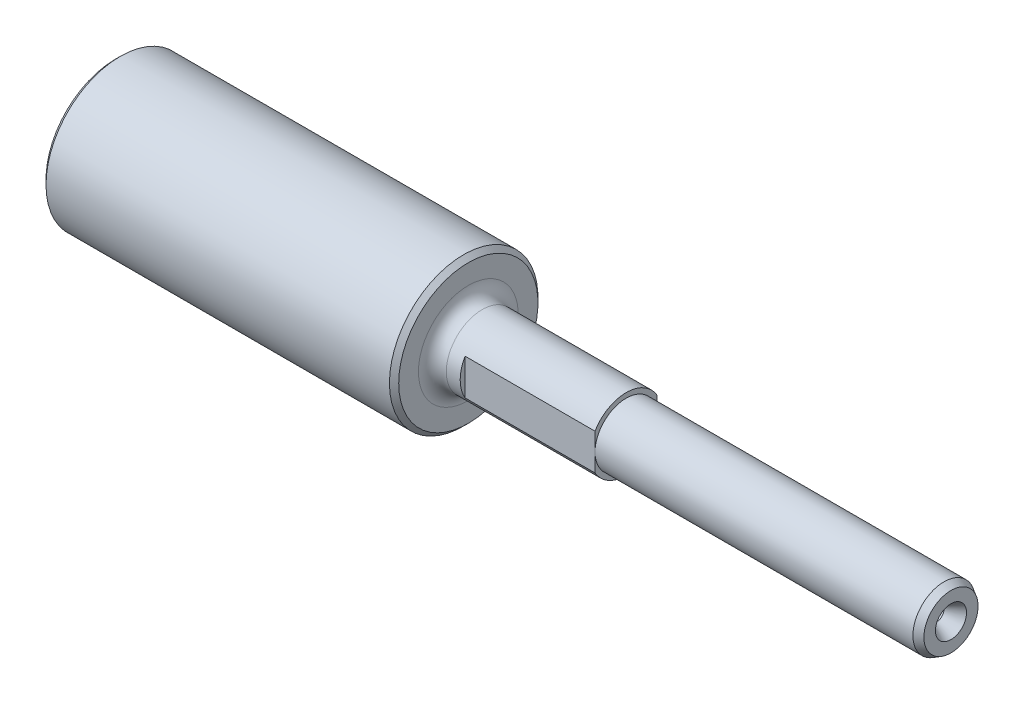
ISO-10303-21;
HEADER;
FILE_DESCRIPTION(('STEP AP214'),'2;1');
FILE_NAME('part.step','',(''),(''),'','','');
FILE_SCHEMA(('AUTOMOTIVE_DESIGN { 1 0 10303 214 1 1 1 1 }'));
ENDSEC;
DATA;
#1=APPLICATION_CONTEXT('core data for automotive mechanical design processes');
#2=APPLICATION_PROTOCOL_DEFINITION('international standard','automotive_design',2000,#1);
#3=PRODUCT_CONTEXT('',#1,'mechanical');
#4=PRODUCT('Part','Part','',(#3));
#5=PRODUCT_RELATED_PRODUCT_CATEGORY('part','',(#4));
#6=PRODUCT_DEFINITION_FORMATION('','',#4);
#7=PRODUCT_DEFINITION_CONTEXT('part definition',#1,'design');
#8=PRODUCT_DEFINITION('design','',#6,#7);
#9=PRODUCT_DEFINITION_SHAPE('','',#8);
#10=(LENGTH_UNIT() NAMED_UNIT(*) SI_UNIT(.MILLI.,.METRE.));
#11=(NAMED_UNIT(*) PLANE_ANGLE_UNIT() SI_UNIT($,.RADIAN.));
#12=(NAMED_UNIT(*) SI_UNIT($,.STERADIAN.) SOLID_ANGLE_UNIT());
#13=UNCERTAINTY_MEASURE_WITH_UNIT(LENGTH_MEASURE(1.E-05),#10,'distance_accuracy_value','');
#14=(GEOMETRIC_REPRESENTATION_CONTEXT(3) GLOBAL_UNCERTAINTY_ASSIGNED_CONTEXT((#13)) GLOBAL_UNIT_ASSIGNED_CONTEXT((#10,
#11,#12)) REPRESENTATION_CONTEXT('',''));
#15=CARTESIAN_POINT('',(0.,0.,0.));
#16=DIRECTION('',(0.,0.,1.));
#17=DIRECTION('',(1.,0.,0.));
#18=AXIS2_PLACEMENT_3D('',#15,#16,#17);
#19=CARTESIAN_POINT('',(0.,-6.7,0.));
#20=DIRECTION('',(-1.,0.,0.));
#21=DIRECTION('',(0.,0.,1.));
#22=AXIS2_PLACEMENT_3D('',#19,#20,#21);
#23=PLANE('',#22);
#24=CARTESIAN_POINT('',(0.,0.,0.));
#25=DIRECTION('',(-1.,0.,0.));
#26=DIRECTION('',(0.,0.,1.));
#27=AXIS2_PLACEMENT_3D('',#24,#25,#26);
#28=CIRCLE('',#27,7.75);
#29=CARTESIAN_POINT('',(0.,-3.89518934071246,-6.7));
#30=VERTEX_POINT('',#29);
#31=CARTESIAN_POINT('',(0.,-3.89518934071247,6.7));
#32=VERTEX_POINT('',#31);
#33=EDGE_CURVE('E60',#30,#32,#28,.T.);
#34=ORIENTED_EDGE('',*,*,#33,.F.);
#35=DIRECTION('',(0.,-1.,0.));
#36=VECTOR('',#35,1.);
#37=CARTESIAN_POINT('',(0.,3.89518934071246,-6.7));
#38=LINE('',#37,#36);
#39=CARTESIAN_POINT('',(0.,0.,-6.7));
#40=VERTEX_POINT('',#39);
#41=EDGE_CURVE('E98',#40,#30,#38,.T.);
#42=ORIENTED_EDGE('',*,*,#41,.F.);
#43=CARTESIAN_POINT('',(0.,0.,0.));
#44=DIRECTION('',(-1.,0.,0.));
#45=DIRECTION('',(0.,0.,1.));
#46=AXIS2_PLACEMENT_3D('',#43,#44,#45);
#47=CIRCLE('',#46,6.7);
#48=CARTESIAN_POINT('',(0.,0.,6.7));
#49=VERTEX_POINT('',#48);
#50=EDGE_CURVE('E129',#40,#49,#47,.T.);
#51=ORIENTED_EDGE('',*,*,#50,.T.);
#52=DIRECTION('',(0.,1.,0.));
#53=VECTOR('',#52,1.);
#54=CARTESIAN_POINT('',(0.,3.89518934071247,6.7));
#55=LINE('',#54,#53);
#56=EDGE_CURVE('E120',#32,#49,#55,.T.);
#57=ORIENTED_EDGE('',*,*,#56,.F.);
#58=EDGE_LOOP('',(#34,#42,#51,#57));
#59=FACE_BOUND('',#58,.T.);
#60=ADVANCED_FACE('F37',(#59),#23,.F.);
#61=CARTESIAN_POINT('',(70.,0.,0.));
#62=DIRECTION('',(-1.,0.,0.));
#63=DIRECTION('',(0.,0.,1.));
#64=AXIS2_PLACEMENT_3D('',#61,#62,#63);
#65=PLANE('',#64);
#66=CARTESIAN_POINT('',(70.,0.,0.));
#67=DIRECTION('',(1.,0.,0.));
#68=DIRECTION('',(0.,0.,-1.));
#69=AXIS2_PLACEMENT_3D('',#66,#67,#68);
#70=CIRCLE('',#69,3.35);
#71=CARTESIAN_POINT('',(70.,0.,-3.35));
#72=VERTEX_POINT('',#71);
#73=EDGE_CURVE('E104',#72,#72,#70,.T.);
#74=ORIENTED_EDGE('',*,*,#73,.F.);
#75=EDGE_LOOP('',(#74));
#76=FACE_BOUND('',#75,.T.);
#77=CARTESIAN_POINT('',(70.,0.,0.));
#78=DIRECTION('',(-1.,0.,0.));
#79=DIRECTION('',(0.,0.,1.));
#80=AXIS2_PLACEMENT_3D('',#77,#78,#79);
#81=CIRCLE('',#80,5.83397459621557);
#82=CARTESIAN_POINT('',(70.,0.,5.83397459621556));
#83=VERTEX_POINT('',#82);
#84=EDGE_CURVE('E140',#83,#83,#81,.F.);
#85=ORIENTED_EDGE('',*,*,#84,.T.);
#86=EDGE_LOOP('',(#85));
#87=FACE_BOUND('',#86,.T.);
#88=ADVANCED_FACE('F179',(#76,#87),#65,.F.);
#89=CARTESIAN_POINT('',(-110.,-16.,1.1172740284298E-13));
#90=DIRECTION('',(1.,0.,0.));
#91=DIRECTION('',(0.,0.,-1.));
#92=AXIS2_PLACEMENT_3D('',#89,#90,#91);
#93=PLANE('',#92);
#94=CARTESIAN_POINT('',(-110.,0.,0.));
#95=DIRECTION('',(1.,0.,0.));
#96=DIRECTION('',(0.,0.,-1.));
#97=AXIS2_PLACEMENT_3D('',#94,#95,#96);
#98=CIRCLE('',#97,15.);
#99=CARTESIAN_POINT('',(-110.,0.,-15.));
#100=VERTEX_POINT('',#99);
#101=EDGE_CURVE('E11',#100,#100,#98,.F.);
#102=ORIENTED_EDGE('',*,*,#101,.T.);
#103=EDGE_LOOP('',(#102));
#104=FACE_BOUND('',#103,.T.);
#105=ADVANCED_FACE('F169',(#104),#93,.F.);
#106=CARTESIAN_POINT('',(0.,0.,0.));
#107=DIRECTION('',(-1.,0.,0.));
#108=DIRECTION('',(0.,0.,1.));
#109=AXIS2_PLACEMENT_3D('',#106,#107,#108);
#110=CYLINDRICAL_SURFACE('',#109,16.);
#111=CARTESIAN_POINT('',(-35.,0.,0.));
#112=DIRECTION('',(-1.,0.,0.));
#113=DIRECTION('',(0.,0.,1.));
#114=AXIS2_PLACEMENT_3D('',#111,#112,#113);
#115=CIRCLE('',#114,16.);
#116=CARTESIAN_POINT('',(-35.,0.,16.));
#117=VERTEX_POINT('',#116);
#118=EDGE_CURVE('E152',#117,#117,#115,.T.);
#119=ORIENTED_EDGE('',*,*,#118,.T.);
#120=EDGE_LOOP('',(#119));
#121=FACE_BOUND('',#120,.T.);
#122=CARTESIAN_POINT('',(-109.,0.,0.));
#123=DIRECTION('',(1.,0.,0.));
#124=DIRECTION('',(0.,0.,-1.));
#125=AXIS2_PLACEMENT_3D('',#122,#123,#124);
#126=CIRCLE('',#125,16.);
#127=CARTESIAN_POINT('',(-109.,0.,-16.));
#128=VERTEX_POINT('',#127);
#129=EDGE_CURVE('E149',#128,#128,#126,.T.);
#130=ORIENTED_EDGE('',*,*,#129,.T.);
#131=EDGE_LOOP('',(#130));
#132=FACE_BOUND('',#131,.T.);
#133=ADVANCED_FACE('F166',(#121,#132),#110,.T.);
#134=CARTESIAN_POINT('',(-34.,-7.75,0.));
#135=DIRECTION('',(-1.,0.,0.));
#136=DIRECTION('',(0.,0.,1.));
#137=AXIS2_PLACEMENT_3D('',#134,#135,#136);
#138=PLANE('',#137);
#139=CARTESIAN_POINT('',(-34.,0.,0.));
#140=DIRECTION('',(-1.,0.,0.));
#141=DIRECTION('',(0.,0.,1.));
#142=AXIS2_PLACEMENT_3D('',#139,#140,#141);
#143=CIRCLE('',#142,15.);
#144=CARTESIAN_POINT('',(-34.,0.,15.));
#145=VERTEX_POINT('',#144);
#146=EDGE_CURVE('E45',#145,#145,#143,.F.);
#147=ORIENTED_EDGE('',*,*,#146,.T.);
#148=EDGE_LOOP('',(#147));
#149=FACE_BOUND('',#148,.T.);
#150=CARTESIAN_POINT('',(-34.,0.,0.));
#151=DIRECTION('',(-1.,0.,0.));
#152=DIRECTION('',(0.,0.,1.));
#153=AXIS2_PLACEMENT_3D('',#150,#151,#152);
#154=CIRCLE('',#153,10.75);
#155=CARTESIAN_POINT('',(-34.,0.,10.75));
#156=VERTEX_POINT('',#155);
#157=EDGE_CURVE('E143',#156,#156,#154,.T.);
#158=ORIENTED_EDGE('',*,*,#157,.T.);
#159=EDGE_LOOP('',(#158));
#160=FACE_BOUND('',#159,.T.);
#161=ADVANCED_FACE('F157',(#149,#160),#138,.F.);
#162=CARTESIAN_POINT('',(0.,0.,0.));
#163=DIRECTION('',(-1.,0.,0.));
#164=DIRECTION('',(0.,0.,1.));
#165=AXIS2_PLACEMENT_3D('',#162,#163,#164);
#166=CYLINDRICAL_SURFACE('',#165,7.75);
#167=CARTESIAN_POINT('',(0.,3.89518934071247,6.7));
#168=VERTEX_POINT('',#167);
#169=CARTESIAN_POINT('',(0.,3.89518934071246,-6.7));
#170=VERTEX_POINT('',#169);
#171=EDGE_CURVE('E134',#168,#170,#28,.T.);
#172=ORIENTED_EDGE('',*,*,#171,.T.);
#173=DIRECTION('',(1.,0.,0.));
#174=VECTOR('',#173,1.);
#175=CARTESIAN_POINT('',(-28.,3.89518934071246,-6.7));
#176=LINE('',#175,#174);
#177=CARTESIAN_POINT('',(-28.,3.89518934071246,-6.7));
#178=VERTEX_POINT('',#177);
#179=EDGE_CURVE('E52',#178,#170,#176,.T.);
#180=ORIENTED_EDGE('',*,*,#179,.F.);
#181=CARTESIAN_POINT('',(-28.,0.,0.));
#182=DIRECTION('',(1.,0.,0.));
#183=DIRECTION('',(0.,0.,-1.));
#184=AXIS2_PLACEMENT_3D('',#181,#182,#183);
#185=CIRCLE('',#184,7.75);
#186=CARTESIAN_POINT('',(-28.,-3.89518934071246,-6.7));
#187=VERTEX_POINT('',#186);
#188=EDGE_CURVE('E108',#187,#178,#185,.T.);
#189=ORIENTED_EDGE('',*,*,#188,.F.);
#190=DIRECTION('',(1.,0.,0.));
#191=VECTOR('',#190,1.);
#192=CARTESIAN_POINT('',(-28.,-3.89518934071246,-6.7));
#193=LINE('',#192,#191);
#194=EDGE_CURVE('E113',#187,#30,#193,.T.);
#195=ORIENTED_EDGE('',*,*,#194,.T.);
#196=ORIENTED_EDGE('',*,*,#33,.T.);
#197=DIRECTION('',(1.,0.,0.));
#198=VECTOR('',#197,1.);
#199=CARTESIAN_POINT('',(-28.,-3.89518934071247,6.7));
#200=LINE('',#199,#198);
#201=CARTESIAN_POINT('',(-28.,-3.89518934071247,6.7));
#202=VERTEX_POINT('',#201);
#203=EDGE_CURVE('E123',#202,#32,#200,.T.);
#204=ORIENTED_EDGE('',*,*,#203,.F.);
#205=CARTESIAN_POINT('',(-28.,0.,0.));
#206=DIRECTION('',(1.,0.,0.));
#207=DIRECTION('',(0.,0.,-1.));
#208=AXIS2_PLACEMENT_3D('',#205,#206,#207);
#209=CIRCLE('',#208,7.75);
#210=CARTESIAN_POINT('',(-28.,3.89518934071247,6.7));
#211=VERTEX_POINT('',#210);
#212=EDGE_CURVE('E117',#211,#202,#209,.T.);
#213=ORIENTED_EDGE('',*,*,#212,.F.);
#214=DIRECTION('',(1.,0.,0.));
#215=VECTOR('',#214,1.);
#216=CARTESIAN_POINT('',(-28.,3.89518934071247,6.7));
#217=LINE('',#216,#215);
#218=EDGE_CURVE('E126',#211,#168,#217,.T.);
#219=ORIENTED_EDGE('',*,*,#218,.T.);
#220=EDGE_LOOP('',(#172,#180,#189,#195,#196,#204,#213,#219));
#221=FACE_BOUND('',#220,.T.);
#222=CARTESIAN_POINT('',(-31.,0.,0.));
#223=DIRECTION('',(-1.,0.,0.));
#224=DIRECTION('',(0.,0.,1.));
#225=AXIS2_PLACEMENT_3D('',#222,#223,#224);
#226=CIRCLE('',#225,7.75);
#227=CARTESIAN_POINT('',(-31.,0.,7.75));
#228=VERTEX_POINT('',#227);
#229=EDGE_CURVE('E146',#228,#228,#226,.F.);
#230=ORIENTED_EDGE('',*,*,#229,.T.);
#231=EDGE_LOOP('',(#230));
#232=FACE_BOUND('',#231,.T.);
#233=ADVANCED_FACE('F196',(#221,#232),#166,.T.);
#234=EDGE_CURVE('E131',#49,#40,#47,.T.);
#235=ORIENTED_EDGE('',*,*,#234,.T.);
#236=EDGE_CURVE('E101',#170,#40,#38,.T.);
#237=ORIENTED_EDGE('',*,*,#236,.F.);
#238=ORIENTED_EDGE('',*,*,#171,.F.);
#239=EDGE_CURVE('E115',#49,#168,#55,.T.);
#240=ORIENTED_EDGE('',*,*,#239,.F.);
#241=EDGE_LOOP('',(#235,#237,#238,#240));
#242=FACE_BOUND('',#241,.T.);
#243=ADVANCED_FACE('F189',(#242),#23,.F.);
#244=CARTESIAN_POINT('',(0.,0.,0.));
#245=DIRECTION('',(-1.,0.,0.));
#246=DIRECTION('',(0.,0.,1.));
#247=AXIS2_PLACEMENT_3D('',#244,#245,#246);
#248=CYLINDRICAL_SURFACE('',#247,6.7);
#249=CARTESIAN_POINT('',(68.5,0.,0.));
#250=DIRECTION('',(-1.,0.,0.));
#251=DIRECTION('',(0.,0.,1.));
#252=AXIS2_PLACEMENT_3D('',#249,#250,#251);
#253=CIRCLE('',#252,6.7);
#254=CARTESIAN_POINT('',(68.5,0.,6.69999999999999));
#255=VERTEX_POINT('',#254);
#256=EDGE_CURVE('E137',#255,#255,#253,.T.);
#257=ORIENTED_EDGE('',*,*,#256,.T.);
#258=EDGE_LOOP('',(#257));
#259=FACE_BOUND('',#258,.T.);
#260=ORIENTED_EDGE('',*,*,#234,.F.);
#261=ORIENTED_EDGE('',*,*,#50,.F.);
#262=EDGE_LOOP('',(#260,#261));
#263=FACE_BOUND('',#262,.T.);
#264=ADVANCED_FACE('F195',(#259,#263),#248,.T.);
#265=CARTESIAN_POINT('',(68.5,0.,0.));
#266=DIRECTION('',(-1.,0.,0.));
#267=DIRECTION('',(0.,0.,1.));
#268=AXIS2_PLACEMENT_3D('',#265,#266,#267);
#269=CONICAL_SURFACE('',#268,6.7,0.523598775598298);
#270=CARTESIAN_POINT('',(70.,0.,5.83397459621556));
#271=CARTESIAN_POINT('',(69.984375,0.,5.84299569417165));
#272=CARTESIAN_POINT('',(69.96875,0.,5.85201679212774));
#273=CARTESIAN_POINT('',(69.9375,0.,5.87005898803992));
#274=CARTESIAN_POINT('',(69.921875,0.,5.879080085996));
#275=CARTESIAN_POINT('',(69.890625,0.,5.89712228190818));
#276=CARTESIAN_POINT('',(69.875,0.,5.90614337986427));
#277=CARTESIAN_POINT('',(69.84375,0.,5.92418557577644));
#278=CARTESIAN_POINT('',(69.828125,0.,5.93320667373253));
#279=CARTESIAN_POINT('',(69.796875,0.,5.95124886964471));
#280=CARTESIAN_POINT('',(69.78125,0.,5.96026996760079));
#281=CARTESIAN_POINT('',(69.75,0.,5.97831216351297));
#282=CARTESIAN_POINT('',(69.734375,0.,5.98733326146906));
#283=CARTESIAN_POINT('',(69.703125,0.,6.00537545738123));
#284=CARTESIAN_POINT('',(69.6875,0.,6.01439655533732));
#285=CARTESIAN_POINT('',(69.65625,0.,6.0324387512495));
#286=CARTESIAN_POINT('',(69.640625,0.,6.04145984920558));
#287=CARTESIAN_POINT('',(69.609375,0.,6.05950204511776));
#288=CARTESIAN_POINT('',(69.59375,0.,6.06852314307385));
#289=CARTESIAN_POINT('',(69.5625,0.,6.08656533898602));
#290=CARTESIAN_POINT('',(69.546875,0.,6.09558643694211));
#291=CARTESIAN_POINT('',(69.515625,0.,6.11362863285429));
#292=CARTESIAN_POINT('',(69.5,0.,6.12264973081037));
#293=CARTESIAN_POINT('',(69.46875,0.,6.14069192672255));
#294=CARTESIAN_POINT('',(69.453125,0.,6.14971302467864));
#295=CARTESIAN_POINT('',(69.421875,0.,6.16775522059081));
#296=CARTESIAN_POINT('',(69.40625,0.,6.1767763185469));
#297=CARTESIAN_POINT('',(69.375,0.,6.19481851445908));
#298=CARTESIAN_POINT('',(69.359375,0.,6.20383961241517));
#299=CARTESIAN_POINT('',(69.328125,0.,6.22188180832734));
#300=CARTESIAN_POINT('',(69.3125,0.,6.23090290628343));
#301=CARTESIAN_POINT('',(69.28125,0.,6.2489451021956));
#302=CARTESIAN_POINT('',(69.265625,0.,6.25796620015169));
#303=CARTESIAN_POINT('',(69.234375,0.,6.27600839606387));
#304=CARTESIAN_POINT('',(69.21875,0.,6.28502949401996));
#305=CARTESIAN_POINT('',(69.1875,0.,6.30307168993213));
#306=CARTESIAN_POINT('',(69.171875,0.,6.31209278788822));
#307=CARTESIAN_POINT('',(69.140625,0.,6.33013498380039));
#308=CARTESIAN_POINT('',(69.125,0.,6.33915608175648));
#309=CARTESIAN_POINT('',(69.09375,0.,6.35719827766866));
#310=CARTESIAN_POINT('',(69.078125,0.,6.36621937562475));
#311=CARTESIAN_POINT('',(69.046875,0.,6.38426157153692));
#312=CARTESIAN_POINT('',(69.03125,0.,6.39328266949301));
#313=CARTESIAN_POINT('',(69.,0.,6.41132486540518));
#314=CARTESIAN_POINT('',(68.984375,0.,6.42034596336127));
#315=CARTESIAN_POINT('',(68.953125,0.,6.43838815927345));
#316=CARTESIAN_POINT('',(68.9375,0.,6.44740925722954));
#317=CARTESIAN_POINT('',(68.90625,0.,6.46545145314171));
#318=CARTESIAN_POINT('',(68.890625,0.,6.4744725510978));
#319=CARTESIAN_POINT('',(68.859375,0.,6.49251474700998));
#320=CARTESIAN_POINT('',(68.84375,0.,6.50153584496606));
#321=CARTESIAN_POINT('',(68.8125,0.,6.51957804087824));
#322=CARTESIAN_POINT('',(68.796875,0.,6.52859913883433));
#323=CARTESIAN_POINT('',(68.765625,0.,6.5466413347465));
#324=CARTESIAN_POINT('',(68.75,0.,6.55566243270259));
#325=CARTESIAN_POINT('',(68.71875,0.,6.57370462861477));
#326=CARTESIAN_POINT('',(68.703125,0.,6.58272572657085));
#327=CARTESIAN_POINT('',(68.671875,0.,6.60076792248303));
#328=CARTESIAN_POINT('',(68.65625,0.,6.60978902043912));
#329=CARTESIAN_POINT('',(68.625,0.,6.62783121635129));
#330=CARTESIAN_POINT('',(68.609375,0.,6.63685231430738));
#331=CARTESIAN_POINT('',(68.578125,0.,6.65489451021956));
#332=CARTESIAN_POINT('',(68.5625,0.,6.66391560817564));
#333=CARTESIAN_POINT('',(68.53125,0.,6.68195780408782));
#334=CARTESIAN_POINT('',(68.515625,0.,6.69097890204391));
#335=CARTESIAN_POINT('',(68.5,0.,6.69999999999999));
#336=B_SPLINE_CURVE_WITH_KNOTS('',3,(#270,#271,#272,#273,#274,#275,#276,#277,#278,#279,#280,
#281,#282,#283,#284,#285,#286,#287,#288,#289,#290,#291,#292,#293,#294,#295,#296,#297,#298,#299,
#300,#301,#302,#303,#304,#305,#306,#307,#308,#309,#310,#311,#312,#313,#314,#315,#316,#317,#318,
#319,#320,#321,#322,#323,#324,#325,#326,#327,#328,#329,#330,#331,#332,#333,#334,#335),
.UNSPECIFIED.,.F.,.F.,(4,2,2,2,2,2,2,2,2,2,2,2,2,2,2,2,2,2,2,2,2,2,2,2,2,2,2,2,2,2,2,2,4),(0.,
0.054126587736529,0.108253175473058,0.162379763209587,0.216506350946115,0.270632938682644,
0.324759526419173,0.37888611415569,0.433012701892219,0.487139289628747,0.541265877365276,
0.595392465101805,0.649519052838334,0.703645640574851,0.75777222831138,0.811898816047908,
0.866025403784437,0.920151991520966,0.974278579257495,1.02840516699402,1.08253175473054,
1.13665834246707,1.1907849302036,1.24491151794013,1.29903810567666,1.35316469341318,
1.4072912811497,1.46141786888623,1.51554445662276,1.56967104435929,1.62379763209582,
1.67792421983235,1.73205080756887),.UNSPECIFIED.);
#337=EDGE_CURVE('BSEAM202',#83,#255,#336,.T.);
#338=ORIENTED_EDGE('',*,*,#84,.F.);
#339=ORIENTED_EDGE('',*,*,#256,.F.);
#340=ORIENTED_EDGE('',*,*,#337,.T.);
#341=ORIENTED_EDGE('',*,*,#337,.F.);
#342=EDGE_LOOP('',(#338,#340,#339,#341));
#343=FACE_BOUND('',#342,.T.);
#344=ADVANCED_FACE('F202',(#343),#269,.T.);
#345=CARTESIAN_POINT('',(-31.,0.,0.));
#346=DIRECTION('',(-1.,0.,0.));
#347=DIRECTION('',(0.,0.,1.));
#348=AXIS2_PLACEMENT_3D('',#345,#346,#347);
#349=TOROIDAL_SURFACE('',#348,10.75,3.);
#350=ORIENTED_EDGE('',*,*,#229,.F.);
#351=EDGE_LOOP('',(#350));
#352=FACE_BOUND('',#351,.T.);
#353=ORIENTED_EDGE('',*,*,#157,.F.);
#354=EDGE_LOOP('',(#353));
#355=FACE_BOUND('',#354,.T.);
#356=ADVANCED_FACE('F163',(#352,#355),#349,.F.);
#357=CARTESIAN_POINT('',(-35.,0.,0.));
#358=DIRECTION('',(-1.,0.,0.));
#359=DIRECTION('',(0.,0.,1.));
#360=AXIS2_PLACEMENT_3D('',#357,#358,#359);
#361=CONICAL_SURFACE('',#360,16.,0.785398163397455);
#362=ORIENTED_EDGE('',*,*,#146,.F.);
#363=EDGE_LOOP('',(#362));
#364=FACE_BOUND('',#363,.T.);
#365=ORIENTED_EDGE('',*,*,#118,.F.);
#366=EDGE_LOOP('',(#365));
#367=FACE_BOUND('',#366,.T.);
#368=ADVANCED_FACE('F160',(#364,#367),#361,.T.);
#369=CARTESIAN_POINT('',(-110.,0.,0.));
#370=DIRECTION('',(1.,0.,0.));
#371=DIRECTION('',(0.,0.,-1.));
#372=AXIS2_PLACEMENT_3D('',#369,#370,#371);
#373=CONICAL_SURFACE('',#372,15.,0.785398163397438);
#374=ORIENTED_EDGE('',*,*,#129,.F.);
#375=EDGE_LOOP('',(#374));
#376=FACE_BOUND('',#375,.T.);
#377=ORIENTED_EDGE('',*,*,#101,.F.);
#378=EDGE_LOOP('',(#377));
#379=FACE_BOUND('',#378,.T.);
#380=ADVANCED_FACE('F39',(#376,#379),#373,.T.);
#381=CARTESIAN_POINT('',(-28.,3.89518934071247,6.7));
#382=DIRECTION('',(0.,0.,-1.));
#383=DIRECTION('',(-1.,0.,0.));
#384=AXIS2_PLACEMENT_3D('',#381,#382,#383);
#385=PLANE('',#384);
#386=ORIENTED_EDGE('',*,*,#56,.T.);
#387=ORIENTED_EDGE('',*,*,#239,.T.);
#388=ORIENTED_EDGE('',*,*,#218,.F.);
#389=DIRECTION('',(0.,1.,0.));
#390=VECTOR('',#389,1.);
#391=CARTESIAN_POINT('',(-28.,3.89518934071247,6.7));
#392=LINE('',#391,#390);
#393=EDGE_CURVE('E119',#202,#211,#392,.T.);
#394=ORIENTED_EDGE('',*,*,#393,.F.);
#395=ORIENTED_EDGE('',*,*,#203,.T.);
#396=EDGE_LOOP('',(#386,#387,#388,#394,#395));
#397=FACE_BOUND('',#396,.T.);
#398=ADVANCED_FACE('F175',(#397),#385,.F.);
#399=CARTESIAN_POINT('',(-28.,0.,0.));
#400=DIRECTION('',(1.,0.,0.));
#401=DIRECTION('',(0.,0.,-1.));
#402=AXIS2_PLACEMENT_3D('',#399,#400,#401);
#403=PLANE('',#402);
#404=ORIENTED_EDGE('',*,*,#212,.T.);
#405=ORIENTED_EDGE('',*,*,#393,.T.);
#406=EDGE_LOOP('',(#404,#405));
#407=FACE_BOUND('',#406,.T.);
#408=ADVANCED_FACE('F216',(#407),#403,.T.);
#409=CARTESIAN_POINT('',(-28.,3.89518934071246,-6.7));
#410=DIRECTION('',(0.,0.,1.));
#411=DIRECTION('',(1.,0.,0.));
#412=AXIS2_PLACEMENT_3D('',#409,#410,#411);
#413=PLANE('',#412);
#414=ORIENTED_EDGE('',*,*,#236,.T.);
#415=ORIENTED_EDGE('',*,*,#41,.T.);
#416=ORIENTED_EDGE('',*,*,#194,.F.);
#417=DIRECTION('',(0.,-1.,0.));
#418=VECTOR('',#417,1.);
#419=CARTESIAN_POINT('',(-28.,3.89518934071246,-6.7));
#420=LINE('',#419,#418);
#421=EDGE_CURVE('E110',#178,#187,#420,.T.);
#422=ORIENTED_EDGE('',*,*,#421,.F.);
#423=ORIENTED_EDGE('',*,*,#179,.T.);
#424=EDGE_LOOP('',(#414,#415,#416,#422,#423));
#425=FACE_BOUND('',#424,.T.);
#426=ADVANCED_FACE('F218',(#425),#413,.F.);
#427=CARTESIAN_POINT('',(-28.,0.,0.));
#428=DIRECTION('',(1.,0.,0.));
#429=DIRECTION('',(0.,0.,-1.));
#430=AXIS2_PLACEMENT_3D('',#427,#428,#429);
#431=PLANE('',#430);
#432=ORIENTED_EDGE('',*,*,#188,.T.);
#433=ORIENTED_EDGE('',*,*,#421,.T.);
#434=EDGE_LOOP('',(#432,#433));
#435=FACE_BOUND('',#434,.T.);
#436=ADVANCED_FACE('F92',(#435),#431,.T.);
#437=CARTESIAN_POINT('',(63.,0.,0.));
#438=DIRECTION('',(1.,0.,0.));
#439=DIRECTION('',(0.,0.,-1.));
#440=AXIS2_PLACEMENT_3D('',#437,#438,#439);
#441=CONICAL_SURFACE('',#440,1.575,1.02974425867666);
#442=CARTESIAN_POINT('',(62.0536445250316,0.,0.));
#443=VERTEX_POINT('',#442);
#444=VERTEX_LOOP('',#443);
#445=FACE_BOUND('',#444,.T.);
#446=CARTESIAN_POINT('',(63.,0.,0.));
#447=DIRECTION('',(1.,0.,0.));
#448=DIRECTION('',(0.,0.,-1.));
#449=AXIS2_PLACEMENT_3D('',#446,#447,#448);
#450=CIRCLE('',#449,1.575);
#451=CARTESIAN_POINT('',(63.,0.,-1.575));
#452=VERTEX_POINT('',#451);
#453=EDGE_CURVE('E96',#452,#452,#450,.T.);
#454=ORIENTED_EDGE('',*,*,#453,.T.);
#455=EDGE_LOOP('',(#454));
#456=FACE_BOUND('',#455,.T.);
#457=ADVANCED_FACE('F88',(#445,#456),#441,.F.);
#458=CARTESIAN_POINT('',(70.,0.,0.));
#459=DIRECTION('',(1.,0.,0.));
#460=DIRECTION('',(0.,0.,-1.));
#461=AXIS2_PLACEMENT_3D('',#458,#459,#460);
#462=CYLINDRICAL_SURFACE('',#461,1.575);
#463=ORIENTED_EDGE('',*,*,#453,.F.);
#464=EDGE_LOOP('',(#463));
#465=FACE_BOUND('',#464,.T.);
#466=CARTESIAN_POINT('',(66.9256098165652,0.,0.));
#467=DIRECTION('',(1.,0.,0.));
#468=DIRECTION('',(0.,0.,-1.));
#469=AXIS2_PLACEMENT_3D('',#466,#467,#468);
#470=CIRCLE('',#469,1.575);
#471=CARTESIAN_POINT('',(66.9256098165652,0.,-1.575));
#472=VERTEX_POINT('',#471);
#473=EDGE_CURVE('E99',#472,#472,#470,.T.);
#474=ORIENTED_EDGE('',*,*,#473,.T.);
#475=EDGE_LOOP('',(#474));
#476=FACE_BOUND('',#475,.T.);
#477=ADVANCED_FACE('F91',(#465,#476),#462,.F.);
#478=CARTESIAN_POINT('',(70.,0.,0.));
#479=DIRECTION('',(1.,0.,0.));
#480=DIRECTION('',(0.,0.,-1.));
#481=AXIS2_PLACEMENT_3D('',#478,#479,#480);
#482=CONICAL_SURFACE('',#481,3.35,0.523598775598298);
#483=ORIENTED_EDGE('',*,*,#473,.F.);
#484=EDGE_LOOP('',(#483));
#485=FACE_BOUND('',#484,.T.);
#486=ORIENTED_EDGE('',*,*,#73,.T.);
#487=EDGE_LOOP('',(#486));
#488=FACE_BOUND('',#487,.T.);
#489=ADVANCED_FACE('F232',(#485,#488),#482,.F.);
#490=CLOSED_SHELL('',(#60,#88,#105,#133,#161,#233,#243,#264,#344,#356,#368,#380,#398,#408,#426,
#436,#457,#477,#489));
#491=MANIFOLD_SOLID_BREP('B2',#490);
#492=ADVANCED_BREP_SHAPE_REPRESENTATION('',(#18,#491),#14);
#493=SHAPE_DEFINITION_REPRESENTATION(#9,#492);
ENDSEC;
END-ISO-10303-21;
